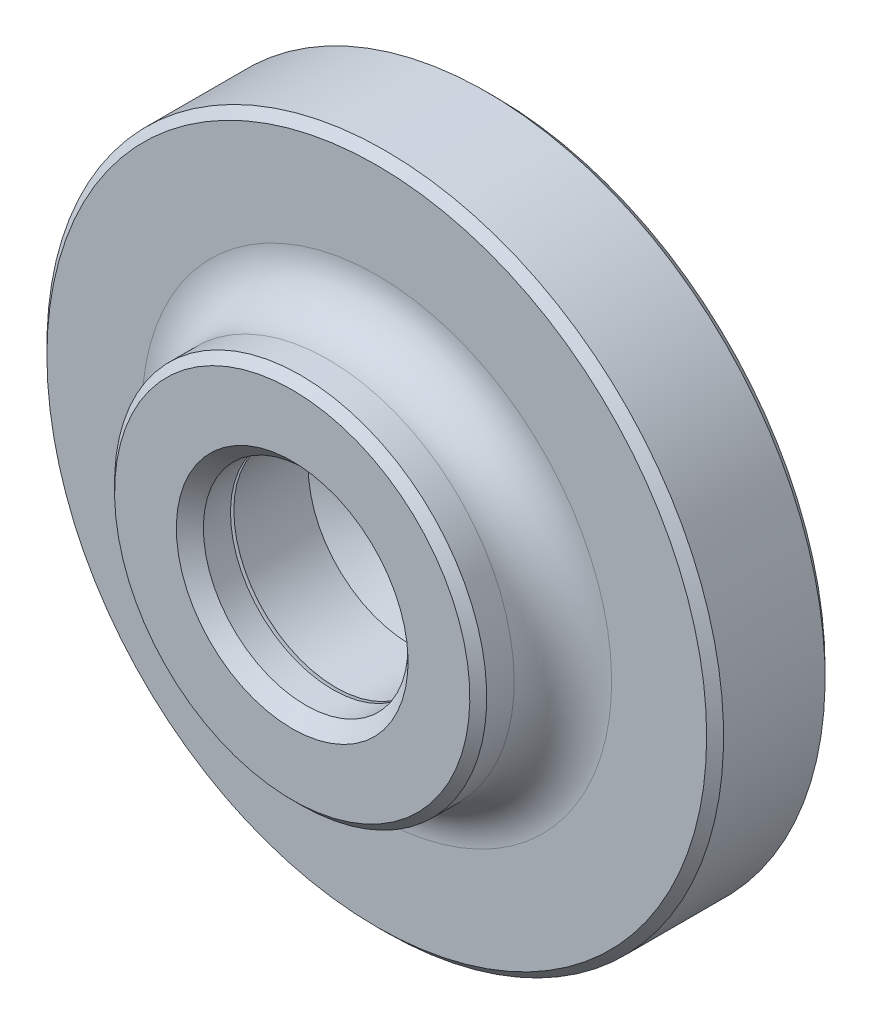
ISO-10303-21;
HEADER;
FILE_DESCRIPTION(('STEP AP214'),'2;1');
FILE_NAME('part.step','',(''),(''),'','','');
FILE_SCHEMA(('AUTOMOTIVE_DESIGN { 1 0 10303 214 1 1 1 1 }'));
ENDSEC;
DATA;
#1=APPLICATION_CONTEXT('core data for automotive mechanical design processes');
#2=APPLICATION_PROTOCOL_DEFINITION('international standard','automotive_design',2000,#1);
#3=PRODUCT_CONTEXT('',#1,'mechanical');
#4=PRODUCT('Part','Part','',(#3));
#5=PRODUCT_RELATED_PRODUCT_CATEGORY('part','',(#4));
#6=PRODUCT_DEFINITION_FORMATION('','',#4);
#7=PRODUCT_DEFINITION_CONTEXT('part definition',#1,'design');
#8=PRODUCT_DEFINITION('design','',#6,#7);
#9=PRODUCT_DEFINITION_SHAPE('','',#8);
#10=(LENGTH_UNIT() NAMED_UNIT(*) SI_UNIT(.MILLI.,.METRE.));
#11=(NAMED_UNIT(*) PLANE_ANGLE_UNIT() SI_UNIT($,.RADIAN.));
#12=(NAMED_UNIT(*) SI_UNIT($,.STERADIAN.) SOLID_ANGLE_UNIT());
#13=UNCERTAINTY_MEASURE_WITH_UNIT(LENGTH_MEASURE(1.E-05),#10,'distance_accuracy_value','');
#14=(GEOMETRIC_REPRESENTATION_CONTEXT(3) GLOBAL_UNCERTAINTY_ASSIGNED_CONTEXT((#13)) GLOBAL_UNIT_ASSIGNED_CONTEXT((#10,
#11,#12)) REPRESENTATION_CONTEXT('',''));
#15=CARTESIAN_POINT('',(0.,0.,0.));
#16=DIRECTION('',(0.,0.,1.));
#17=DIRECTION('',(1.,0.,0.));
#18=AXIS2_PLACEMENT_3D('',#15,#16,#17);
#19=CARTESIAN_POINT('',(0.,0.,5.000000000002));
#20=DIRECTION('',(0.,0.,1.));
#21=DIRECTION('',(0.,-1.,0.));
#22=AXIS2_PLACEMENT_3D('',#19,#20,#21);
#23=CONICAL_SURFACE('',#22,6.04999999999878,1.0471975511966);
#24=CARTESIAN_POINT('',(0.,0.,1.50703087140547));
#25=VERTEX_POINT('',#24);
#26=VERTEX_LOOP('',#25);
#27=FACE_BOUND('',#26,.T.);
#28=CARTESIAN_POINT('',(0.,0.,5.));
#29=DIRECTION('',(0.,0.,1.));
#30=DIRECTION('',(0.,-1.,0.));
#31=AXIS2_PLACEMENT_3D('',#28,#29,#30);
#32=CIRCLE('',#31,6.05);
#33=CARTESIAN_POINT('',(0.,-6.05,5.));
#34=VERTEX_POINT('',#33);
#35=EDGE_CURVE('E34',#34,#34,#32,.T.);
#36=ORIENTED_EDGE('',*,*,#35,.T.);
#37=EDGE_LOOP('',(#36));
#38=FACE_BOUND('',#37,.T.);
#39=ADVANCED_FACE('F14',(#27,#38),#23,.F.);
#40=CARTESIAN_POINT('',(0.,0.,0.));
#41=DIRECTION('',(0.,0.,1.));
#42=DIRECTION('',(0.,-1.,0.));
#43=AXIS2_PLACEMENT_3D('',#40,#41,#42);
#44=CYLINDRICAL_SURFACE('',#43,6.05);
#45=ORIENTED_EDGE('',*,*,#35,.F.);
#46=EDGE_LOOP('',(#45));
#47=FACE_BOUND('',#46,.T.);
#48=CARTESIAN_POINT('',(0.,0.,9.4));
#49=DIRECTION('',(0.,0.,-1.));
#50=DIRECTION('',(0.,1.,0.));
#51=AXIS2_PLACEMENT_3D('',#48,#49,#50);
#52=CIRCLE('',#51,6.05);
#53=CARTESIAN_POINT('',(0.,6.05,9.4));
#54=VERTEX_POINT('',#53);
#55=EDGE_CURVE('E36',#54,#54,#52,.F.);
#56=ORIENTED_EDGE('',*,*,#55,.T.);
#57=EDGE_LOOP('',(#56));
#58=FACE_BOUND('',#57,.T.);
#59=ADVANCED_FACE('F31',(#47,#58),#44,.F.);
#60=CARTESIAN_POINT('',(0.,0.,10.));
#61=DIRECTION('',(0.,0.,-1.));
#62=DIRECTION('',(0.,1.,0.));
#63=AXIS2_PLACEMENT_3D('',#60,#61,#62);
#64=TOROIDAL_SURFACE('',#63,6.05,0.6);
#65=ORIENTED_EDGE('',*,*,#55,.F.);
#66=EDGE_LOOP('',(#65));
#67=FACE_BOUND('',#66,.T.);
#68=CARTESIAN_POINT('',(0.,0.,9.6));
#69=DIRECTION('',(0.,0.,-1.));
#70=DIRECTION('',(0.,1.,0.));
#71=AXIS2_PLACEMENT_3D('',#68,#69,#70);
#72=CIRCLE('',#71,6.49721359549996);
#73=CARTESIAN_POINT('',(0.,6.49721359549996,9.6));
#74=VERTEX_POINT('',#73);
#75=EDGE_CURVE('E17',#74,#74,#72,.F.);
#76=ORIENTED_EDGE('',*,*,#75,.T.);
#77=EDGE_LOOP('',(#76));
#78=FACE_BOUND('',#77,.T.);
#79=ADVANCED_FACE('F69',(#67,#78),#64,.F.);
#80=CARTESIAN_POINT('',(6.5,0.,9.6));
#81=DIRECTION('',(0.,0.,1.));
#82=DIRECTION('',(0.,-1.,0.));
#83=AXIS2_PLACEMENT_3D('',#80,#81,#82);
#84=PLANE('',#83);
#85=ORIENTED_EDGE('',*,*,#75,.F.);
#86=EDGE_LOOP('',(#85));
#87=FACE_BOUND('',#86,.T.);
#88=CARTESIAN_POINT('',(0.,0.,9.6));
#89=DIRECTION('',(0.,0.,1.));
#90=DIRECTION('',(0.,-1.,0.));
#91=AXIS2_PLACEMENT_3D('',#88,#89,#90);
#92=CIRCLE('',#91,6.05);
#93=CARTESIAN_POINT('',(0.,-6.05,9.6));
#94=VERTEX_POINT('',#93);
#95=EDGE_CURVE('E60',#94,#94,#92,.T.);
#96=ORIENTED_EDGE('',*,*,#95,.T.);
#97=EDGE_LOOP('',(#96));
#98=FACE_BOUND('',#97,.T.);
#99=ADVANCED_FACE('F71',(#87,#98),#84,.F.);
#100=CARTESIAN_POINT('',(0.,0.,0.));
#101=DIRECTION('',(0.,0.,1.));
#102=DIRECTION('',(0.,-1.,0.));
#103=AXIS2_PLACEMENT_3D('',#100,#101,#102);
#104=CYLINDRICAL_SURFACE('',#103,6.05);
#105=ORIENTED_EDGE('',*,*,#95,.F.);
#106=EDGE_LOOP('',(#105));
#107=FACE_BOUND('',#106,.T.);
#108=CARTESIAN_POINT('',(0.,0.,11.2007999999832));
#109=DIRECTION('',(0.,0.,1.));
#110=DIRECTION('',(0.,-1.,0.));
#111=AXIS2_PLACEMENT_3D('',#108,#109,#110);
#112=CIRCLE('',#111,6.04999999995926);
#113=CARTESIAN_POINT('',(0.,-6.04999999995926,11.2007999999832));
#114=VERTEX_POINT('',#113);
#115=EDGE_CURVE('E59',#114,#114,#112,.T.);
#116=ORIENTED_EDGE('',*,*,#115,.T.);
#117=EDGE_LOOP('',(#116));
#118=FACE_BOUND('',#117,.T.);
#119=ADVANCED_FACE('F73',(#107,#118),#104,.F.);
#120=CARTESIAN_POINT('',(0.,0.,11.9999999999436));
#121=DIRECTION('',(0.,0.,1.));
#122=DIRECTION('',(0.,-1.,0.));
#123=AXIS2_PLACEMENT_3D('',#120,#121,#122);
#124=CONICAL_SURFACE('',#123,6.84919999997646,0.785398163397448);
#125=ORIENTED_EDGE('',*,*,#115,.F.);
#126=EDGE_LOOP('',(#125));
#127=FACE_BOUND('',#126,.T.);
#128=CARTESIAN_POINT('',(0.,0.,11.9999999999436));
#129=DIRECTION('',(0.,0.,1.));
#130=DIRECTION('',(0.,-1.,0.));
#131=AXIS2_PLACEMENT_3D('',#128,#129,#130);
#132=CIRCLE('',#131,6.84919999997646);
#133=CARTESIAN_POINT('',(0.,-6.84919999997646,11.9999999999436));
#134=VERTEX_POINT('',#133);
#135=EDGE_CURVE('E57',#134,#134,#132,.T.);
#136=ORIENTED_EDGE('',*,*,#135,.T.);
#137=EDGE_LOOP('',(#136));
#138=FACE_BOUND('',#137,.T.);
#139=ADVANCED_FACE('F81',(#127,#138),#124,.F.);
#140=CARTESIAN_POINT('',(7.05,0.,12.));
#141=DIRECTION('',(0.,0.,-1.));
#142=DIRECTION('',(0.,1.,0.));
#143=AXIS2_PLACEMENT_3D('',#140,#141,#142);
#144=PLANE('',#143);
#145=ORIENTED_EDGE('',*,*,#135,.F.);
#146=EDGE_LOOP('',(#145));
#147=FACE_BOUND('',#146,.T.);
#148=CARTESIAN_POINT('',(0.,0.,12.));
#149=DIRECTION('',(0.,0.,-1.));
#150=DIRECTION('',(0.,1.,0.));
#151=AXIS2_PLACEMENT_3D('',#148,#149,#150);
#152=CIRCLE('',#151,10.5);
#153=CARTESIAN_POINT('',(0.,10.5,12.));
#154=VERTEX_POINT('',#153);
#155=EDGE_CURVE('E53',#154,#154,#152,.T.);
#156=ORIENTED_EDGE('',*,*,#155,.F.);
#157=EDGE_LOOP('',(#156));
#158=FACE_BOUND('',#157,.T.);
#159=ADVANCED_FACE('F238',(#147,#158),#144,.F.);
#160=CARTESIAN_POINT('',(0.,0.,11.5));
#161=DIRECTION('',(0.,0.,-1.));
#162=DIRECTION('',(0.,1.,0.));
#163=AXIS2_PLACEMENT_3D('',#160,#161,#162);
#164=CONICAL_SURFACE('',#163,11.,0.785398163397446);
#165=ORIENTED_EDGE('',*,*,#155,.T.);
#166=EDGE_LOOP('',(#165));
#167=FACE_BOUND('',#166,.T.);
#168=CARTESIAN_POINT('',(0.,0.,11.5));
#169=DIRECTION('',(0.,0.,1.));
#170=DIRECTION('',(0.,-1.,0.));
#171=AXIS2_PLACEMENT_3D('',#168,#169,#170);
#172=CIRCLE('',#171,11.);
#173=CARTESIAN_POINT('',(0.,-11.,11.5));
#174=VERTEX_POINT('',#173);
#175=EDGE_CURVE('E56',#174,#174,#172,.F.);
#176=ORIENTED_EDGE('',*,*,#175,.F.);
#177=EDGE_LOOP('',(#176));
#178=FACE_BOUND('',#177,.T.);
#179=ADVANCED_FACE('F230',(#167,#178),#164,.T.);
#180=CARTESIAN_POINT('',(0.,0.,0.));
#181=DIRECTION('',(0.,0.,1.));
#182=DIRECTION('',(0.,-1.,0.));
#183=AXIS2_PLACEMENT_3D('',#180,#181,#182);
#184=CYLINDRICAL_SURFACE('',#183,11.);
#185=ORIENTED_EDGE('',*,*,#175,.T.);
#186=EDGE_LOOP('',(#185));
#187=FACE_BOUND('',#186,.T.);
#188=CARTESIAN_POINT('',(0.,0.,9.88));
#189=DIRECTION('',(0.,0.,-1.));
#190=DIRECTION('',(0.,1.,0.));
#191=AXIS2_PLACEMENT_3D('',#188,#189,#190);
#192=CIRCLE('',#191,11.);
#193=CARTESIAN_POINT('',(0.,11.,9.88));
#194=VERTEX_POINT('',#193);
#195=EDGE_CURVE('E133',#194,#194,#192,.F.);
#196=ORIENTED_EDGE('',*,*,#195,.T.);
#197=EDGE_LOOP('',(#196));
#198=FACE_BOUND('',#197,.T.);
#199=ADVANCED_FACE('F223',(#187,#198),#184,.T.);
#200=CARTESIAN_POINT('',(0.,0.,9.88));
#201=DIRECTION('',(0.,0.,-1.));
#202=DIRECTION('',(0.,1.,0.));
#203=AXIS2_PLACEMENT_3D('',#200,#201,#202);
#204=TOROIDAL_SURFACE('',#203,13.88,2.88);
#205=ORIENTED_EDGE('',*,*,#195,.F.);
#206=EDGE_LOOP('',(#205));
#207=FACE_BOUND('',#206,.T.);
#208=CARTESIAN_POINT('',(0.,0.,7.));
#209=DIRECTION('',(0.,0.,1.));
#210=DIRECTION('',(0.,1.,0.));
#211=AXIS2_PLACEMENT_3D('',#208,#209,#210);
#212=CIRCLE('',#211,13.88);
#213=CARTESIAN_POINT('',(0.,13.88,7.));
#214=VERTEX_POINT('',#213);
#215=EDGE_CURVE('E52',#214,#214,#212,.T.);
#216=ORIENTED_EDGE('',*,*,#215,.T.);
#217=EDGE_LOOP('',(#216));
#218=FACE_BOUND('',#217,.T.);
#219=ADVANCED_FACE('F115',(#207,#218),#204,.F.);
#220=CARTESIAN_POINT('',(13.,0.,7.));
#221=DIRECTION('',(0.,0.,-1.));
#222=DIRECTION('',(0.,1.,0.));
#223=AXIS2_PLACEMENT_3D('',#220,#221,#222);
#224=PLANE('',#223);
#225=ORIENTED_EDGE('',*,*,#215,.F.);
#226=EDGE_LOOP('',(#225));
#227=FACE_BOUND('',#226,.T.);
#228=CARTESIAN_POINT('',(0.,0.,7.));
#229=DIRECTION('',(0.,0.,-1.));
#230=DIRECTION('',(0.,1.,0.));
#231=AXIS2_PLACEMENT_3D('',#228,#229,#230);
#232=CIRCLE('',#231,19.5);
#233=CARTESIAN_POINT('',(0.,19.5,7.));
#234=VERTEX_POINT('',#233);
#235=EDGE_CURVE('E48',#234,#234,#232,.T.);
#236=ORIENTED_EDGE('',*,*,#235,.F.);
#237=EDGE_LOOP('',(#236));
#238=FACE_BOUND('',#237,.T.);
#239=ADVANCED_FACE('F110',(#227,#238),#224,.F.);
#240=CARTESIAN_POINT('',(0.,0.,6.5));
#241=DIRECTION('',(0.,0.,-1.));
#242=DIRECTION('',(0.,1.,0.));
#243=AXIS2_PLACEMENT_3D('',#240,#241,#242);
#244=CONICAL_SURFACE('',#243,20.,0.785398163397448);
#245=ORIENTED_EDGE('',*,*,#235,.T.);
#246=EDGE_LOOP('',(#245));
#247=FACE_BOUND('',#246,.T.);
#248=CARTESIAN_POINT('',(0.,0.,6.5));
#249=DIRECTION('',(0.,0.,1.));
#250=DIRECTION('',(0.,-1.,0.));
#251=AXIS2_PLACEMENT_3D('',#248,#249,#250);
#252=CIRCLE('',#251,20.);
#253=CARTESIAN_POINT('',(0.,-20.,6.5));
#254=VERTEX_POINT('',#253);
#255=EDGE_CURVE('E51',#254,#254,#252,.F.);
#256=ORIENTED_EDGE('',*,*,#255,.F.);
#257=EDGE_LOOP('',(#256));
#258=FACE_BOUND('',#257,.T.);
#259=ADVANCED_FACE('F106',(#247,#258),#244,.T.);
#260=CARTESIAN_POINT('',(0.,0.,0.));
#261=DIRECTION('',(0.,0.,1.));
#262=DIRECTION('',(0.,-1.,0.));
#263=AXIS2_PLACEMENT_3D('',#260,#261,#262);
#264=CYLINDRICAL_SURFACE('',#263,20.);
#265=ORIENTED_EDGE('',*,*,#255,.T.);
#266=EDGE_LOOP('',(#265));
#267=FACE_BOUND('',#266,.T.);
#268=CARTESIAN_POINT('',(0.,0.,0.5));
#269=DIRECTION('',(0.,0.,1.));
#270=DIRECTION('',(0.,-1.,0.));
#271=AXIS2_PLACEMENT_3D('',#268,#269,#270);
#272=CIRCLE('',#271,20.);
#273=CARTESIAN_POINT('',(0.,-20.,0.5));
#274=VERTEX_POINT('',#273);
#275=EDGE_CURVE('E47',#274,#274,#272,.F.);
#276=ORIENTED_EDGE('',*,*,#275,.F.);
#277=EDGE_LOOP('',(#276));
#278=FACE_BOUND('',#277,.T.);
#279=ADVANCED_FACE('F103',(#267,#278),#264,.T.);
#280=CARTESIAN_POINT('',(0.,0.,3.99680288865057E-12));
#281=DIRECTION('',(0.,0.,-1.));
#282=DIRECTION('',(0.,1.,0.));
#283=AXIS2_PLACEMENT_3D('',#280,#281,#282);
#284=CONICAL_SURFACE('',#283,0.998567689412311,1.02974425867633);
#285=CARTESIAN_POINT('',(0.,-2.22044604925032E-13,0.600000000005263));
#286=VERTEX_POINT('',#285);
#287=VERTEX_LOOP('',#286);
#288=FACE_BOUND('',#287,.T.);
#289=CARTESIAN_POINT('',(0.,0.,3.86338502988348E-12));
#290=DIRECTION('',(0.,0.,-1.));
#291=DIRECTION('',(0.,1.,0.));
#292=AXIS2_PLACEMENT_3D('',#289,#290,#291);
#293=CIRCLE('',#292,0.998567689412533);
#294=CARTESIAN_POINT('',(0.,0.998567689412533,3.86338502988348E-12));
#295=VERTEX_POINT('',#294);
#296=EDGE_CURVE('E23',#295,#295,#293,.T.);
#297=ORIENTED_EDGE('',*,*,#296,.T.);
#298=EDGE_LOOP('',(#297));
#299=FACE_BOUND('',#298,.T.);
#300=ADVANCED_FACE('F95',(#288,#299),#284,.F.);
#301=CARTESIAN_POINT('',(0.,0.,0.5));
#302=DIRECTION('',(0.,0.,1.));
#303=DIRECTION('',(-1.,0.,0.));
#304=AXIS2_PLACEMENT_3D('',#301,#302,#303);
#305=CONICAL_SURFACE('',#304,20.,0.785398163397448);
#306=ORIENTED_EDGE('',*,*,#275,.T.);
#307=EDGE_LOOP('',(#306));
#308=FACE_BOUND('',#307,.T.);
#309=CARTESIAN_POINT('',(0.,0.,0.));
#310=DIRECTION('',(0.,0.,1.));
#311=DIRECTION('',(-1.,0.,0.));
#312=AXIS2_PLACEMENT_3D('',#309,#310,#311);
#313=CIRCLE('',#312,19.5);
#314=CARTESIAN_POINT('',(-19.5,0.,0.));
#315=VERTEX_POINT('',#314);
#316=EDGE_CURVE('E9',#315,#315,#313,.T.);
#317=ORIENTED_EDGE('',*,*,#316,.T.);
#318=EDGE_LOOP('',(#317));
#319=FACE_BOUND('',#318,.T.);
#320=ADVANCED_FACE('F88',(#308,#319),#305,.T.);
#321=CARTESIAN_POINT('',(19.5,0.,0.));
#322=DIRECTION('',(0.,0.,1.));
#323=DIRECTION('',(0.,-1.,0.));
#324=AXIS2_PLACEMENT_3D('',#321,#322,#323);
#325=PLANE('',#324);
#326=ORIENTED_EDGE('',*,*,#316,.F.);
#327=EDGE_LOOP('',(#326));
#328=FACE_BOUND('',#327,.T.);
#329=ORIENTED_EDGE('',*,*,#296,.F.);
#330=EDGE_LOOP('',(#329));
#331=FACE_BOUND('',#330,.T.);
#332=ADVANCED_FACE('F86',(#328,#331),#325,.F.);
#333=CLOSED_SHELL('',(#39,#59,#79,#99,#119,#139,#159,#179,#199,#219,#239,#259,#279,#300,#320,#332));
#334=MANIFOLD_SOLID_BREP('B1',#333);
#335=ADVANCED_BREP_SHAPE_REPRESENTATION('',(#18,#334),#14);
#336=SHAPE_DEFINITION_REPRESENTATION(#9,#335);
ENDSEC;
END-ISO-10303-21;
